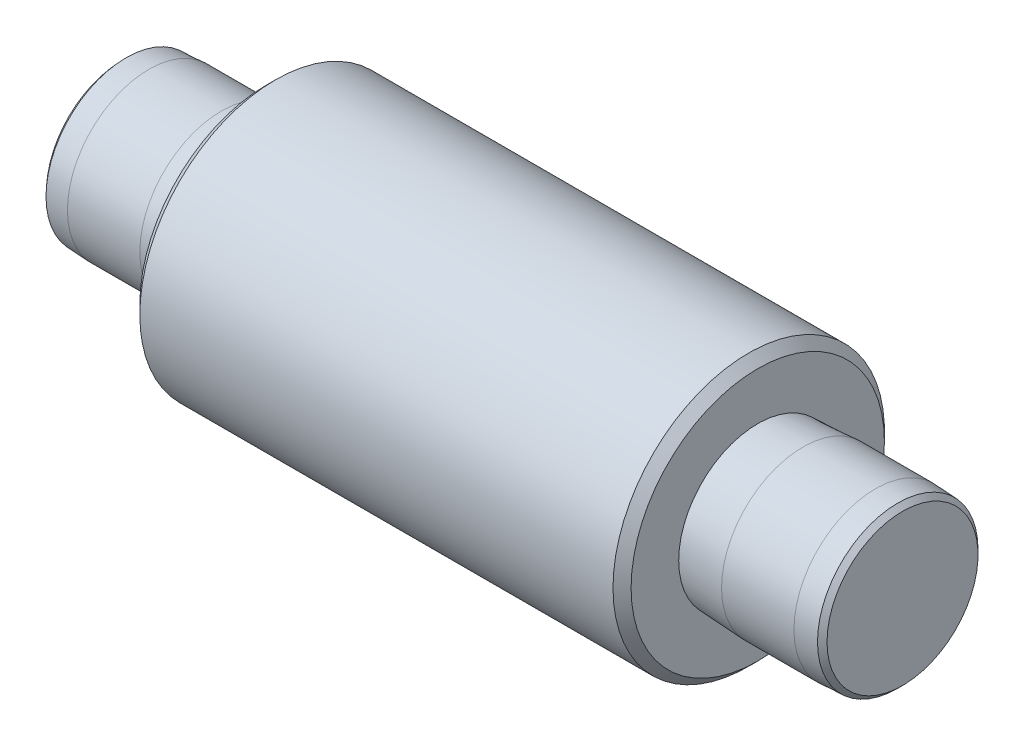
ISO-10303-21;
HEADER;
FILE_DESCRIPTION(('STEP AP214'),'2;1');
FILE_NAME('part.step','',(''),(''),'','','');
FILE_SCHEMA(('AUTOMOTIVE_DESIGN { 1 0 10303 214 1 1 1 1 }'));
ENDSEC;
DATA;
#1=APPLICATION_CONTEXT('core data for automotive mechanical design processes');
#2=APPLICATION_PROTOCOL_DEFINITION('international standard','automotive_design',2000,#1);
#3=PRODUCT_CONTEXT('',#1,'mechanical');
#4=PRODUCT('Part','Part','',(#3));
#5=PRODUCT_RELATED_PRODUCT_CATEGORY('part','',(#4));
#6=PRODUCT_DEFINITION_FORMATION('','',#4);
#7=PRODUCT_DEFINITION_CONTEXT('part definition',#1,'design');
#8=PRODUCT_DEFINITION('design','',#6,#7);
#9=PRODUCT_DEFINITION_SHAPE('','',#8);
#10=(LENGTH_UNIT() NAMED_UNIT(*) SI_UNIT(.MILLI.,.METRE.));
#11=(NAMED_UNIT(*) PLANE_ANGLE_UNIT() SI_UNIT($,.RADIAN.));
#12=(NAMED_UNIT(*) SI_UNIT($,.STERADIAN.) SOLID_ANGLE_UNIT());
#13=UNCERTAINTY_MEASURE_WITH_UNIT(LENGTH_MEASURE(1.E-05),#10,'distance_accuracy_value','');
#14=(GEOMETRIC_REPRESENTATION_CONTEXT(3) GLOBAL_UNCERTAINTY_ASSIGNED_CONTEXT((#13)) GLOBAL_UNIT_ASSIGNED_CONTEXT((#10,
#11,#12)) REPRESENTATION_CONTEXT('',''));
#15=CARTESIAN_POINT('',(0.,0.,0.));
#16=DIRECTION('',(0.,0.,1.));
#17=DIRECTION('',(1.,0.,0.));
#18=AXIS2_PLACEMENT_3D('',#15,#16,#17);
#19=CARTESIAN_POINT('',(-130.,0.,0.));
#20=DIRECTION('',(-1.,0.,0.));
#21=DIRECTION('',(0.,0.,1.));
#22=AXIS2_PLACEMENT_3D('',#19,#20,#21);
#23=CYLINDRICAL_SURFACE('',#22,9.);
#24=CARTESIAN_POINT('',(-109.838114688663,0.,0.));
#25=DIRECTION('',(-1.,0.,0.));
#26=DIRECTION('',(0.,0.,1.));
#27=AXIS2_PLACEMENT_3D('',#24,#25,#26);
#28=CIRCLE('',#27,9.);
#29=CARTESIAN_POINT('',(-109.838114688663,0.,9.));
#30=VERTEX_POINT('',#29);
#31=EDGE_CURVE('E61',#30,#30,#28,.T.);
#32=ORIENTED_EDGE('',*,*,#31,.F.);
#33=EDGE_LOOP('',(#32));
#34=FACE_BOUND('',#33,.T.);
#35=CARTESIAN_POINT('',(-101.838114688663,0.,0.));
#36=DIRECTION('',(-1.,0.,0.));
#37=DIRECTION('',(0.,0.,1.));
#38=AXIS2_PLACEMENT_3D('',#35,#36,#37);
#39=CIRCLE('',#38,9.);
#40=CARTESIAN_POINT('',(-101.838114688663,0.,9.));
#41=VERTEX_POINT('',#40);
#42=EDGE_CURVE('E76',#41,#41,#39,.T.);
#43=ORIENTED_EDGE('',*,*,#42,.T.);
#44=EDGE_LOOP('',(#43));
#45=FACE_BOUND('',#44,.T.);
#46=ADVANCED_FACE('F29',(#34,#45),#23,.T.);
#47=CARTESIAN_POINT('',(-109.838114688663,0.,0.));
#48=DIRECTION('',(1.,0.,0.));
#49=DIRECTION('',(0.,0.,-1.));
#50=AXIS2_PLACEMENT_3D('',#47,#48,#49);
#51=CONICAL_SURFACE('',#50,9.,0.0523598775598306);
#52=CARTESIAN_POINT('',(-112.338799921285,0.,0.));
#53=DIRECTION('',(-1.,0.,0.));
#54=DIRECTION('',(0.,0.,1.));
#55=AXIS2_PLACEMENT_3D('',#52,#53,#54);
#56=CIRCLE('',#55,8.86894464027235);
#57=CARTESIAN_POINT('',(-112.338799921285,0.,8.86894464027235));
#58=VERTEX_POINT('',#57);
#59=EDGE_CURVE('E10',#58,#58,#56,.F.);
#60=ORIENTED_EDGE('',*,*,#59,.T.);
#61=EDGE_LOOP('',(#60));
#62=FACE_BOUND('',#61,.T.);
#63=ORIENTED_EDGE('',*,*,#31,.T.);
#64=EDGE_LOOP('',(#63));
#65=FACE_BOUND('',#64,.T.);
#66=ADVANCED_FACE('F100',(#62,#65),#51,.T.);
#67=CARTESIAN_POINT('',(-112.838114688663,8.84277666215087,0.));
#68=DIRECTION('',(1.,0.,0.));
#69=DIRECTION('',(0.,0.,-1.));
#70=AXIS2_PLACEMENT_3D('',#67,#68,#69);
#71=PLANE('',#70);
#72=CARTESIAN_POINT('',(-112.838114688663,0.,0.));
#73=DIRECTION('',(1.,0.,0.));
#74=DIRECTION('',(0.,0.,-1.));
#75=AXIS2_PLACEMENT_3D('',#72,#73,#74);
#76=CIRCLE('',#75,8.31439941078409);
#77=CARTESIAN_POINT('',(-112.838114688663,0.,-8.31439941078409));
#78=VERTEX_POINT('',#77);
#79=EDGE_CURVE('E36',#78,#78,#76,.F.);
#80=ORIENTED_EDGE('',*,*,#79,.T.);
#81=EDGE_LOOP('',(#80));
#82=FACE_BOUND('',#81,.T.);
#83=ADVANCED_FACE('F106',(#82),#71,.F.);
#84=CARTESIAN_POINT('',(-26.5381146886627,8.84277666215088,0.));
#85=DIRECTION('',(-1.,0.,0.));
#86=DIRECTION('',(0.,0.,1.));
#87=AXIS2_PLACEMENT_3D('',#84,#85,#86);
#88=PLANE('',#87);
#89=CARTESIAN_POINT('',(-26.5381146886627,0.,0.));
#90=DIRECTION('',(-1.,0.,0.));
#91=DIRECTION('',(0.,0.,1.));
#92=AXIS2_PLACEMENT_3D('',#89,#90,#91);
#93=CIRCLE('',#92,8.34277666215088);
#94=CARTESIAN_POINT('',(-26.5381146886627,0.,8.34277666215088));
#95=VERTEX_POINT('',#94);
#96=EDGE_CURVE('E40',#95,#95,#93,.F.);
#97=ORIENTED_EDGE('',*,*,#96,.T.);
#98=EDGE_LOOP('',(#97));
#99=FACE_BOUND('',#98,.T.);
#100=ADVANCED_FACE('F132',(#99),#88,.F.);
#101=CARTESIAN_POINT('',(-26.5381146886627,0.,0.));
#102=DIRECTION('',(-1.,0.,0.));
#103=DIRECTION('',(0.,0.,1.));
#104=AXIS2_PLACEMENT_3D('',#101,#102,#103);
#105=CONICAL_SURFACE('',#104,8.84277666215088,0.0523598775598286);
#106=CARTESIAN_POINT('',(-27.0657678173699,0.,0.));
#107=DIRECTION('',(1.,0.,0.));
#108=DIRECTION('',(0.,0.,-1.));
#109=AXIS2_PLACEMENT_3D('',#106,#107,#108);
#110=CIRCLE('',#109,8.87042979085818);
#111=CARTESIAN_POINT('',(-27.0657678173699,0.,-8.87042979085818));
#112=VERTEX_POINT('',#111);
#113=EDGE_CURVE('E44',#112,#112,#110,.F.);
#114=ORIENTED_EDGE('',*,*,#113,.T.);
#115=EDGE_LOOP('',(#114));
#116=FACE_BOUND('',#115,.T.);
#117=CARTESIAN_POINT('',(-29.5381146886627,0.,0.));
#118=DIRECTION('',(-1.,0.,0.));
#119=DIRECTION('',(0.,0.,1.));
#120=AXIS2_PLACEMENT_3D('',#117,#118,#119);
#121=CIRCLE('',#120,9.);
#122=CARTESIAN_POINT('',(-29.5381146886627,0.,9.));
#123=VERTEX_POINT('',#122);
#124=EDGE_CURVE('E64',#123,#123,#121,.T.);
#125=ORIENTED_EDGE('',*,*,#124,.F.);
#126=EDGE_LOOP('',(#125));
#127=FACE_BOUND('',#126,.T.);
#128=ADVANCED_FACE('F128',(#116,#127),#105,.T.);
#129=CARTESIAN_POINT('',(-130.,0.,0.));
#130=DIRECTION('',(-1.,0.,0.));
#131=DIRECTION('',(0.,0.,1.));
#132=AXIS2_PLACEMENT_3D('',#129,#130,#131);
#133=CYLINDRICAL_SURFACE('',#132,9.);
#134=CARTESIAN_POINT('',(-37.5381146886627,0.,0.));
#135=DIRECTION('',(-1.,0.,0.));
#136=DIRECTION('',(0.,0.,1.));
#137=AXIS2_PLACEMENT_3D('',#134,#135,#136);
#138=CIRCLE('',#137,9.);
#139=CARTESIAN_POINT('',(-37.5381146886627,0.,9.));
#140=VERTEX_POINT('',#139);
#141=EDGE_CURVE('E67',#140,#140,#138,.T.);
#142=ORIENTED_EDGE('',*,*,#141,.F.);
#143=EDGE_LOOP('',(#142));
#144=FACE_BOUND('',#143,.T.);
#145=ORIENTED_EDGE('',*,*,#124,.T.);
#146=EDGE_LOOP('',(#145));
#147=FACE_BOUND('',#146,.T.);
#148=ADVANCED_FACE('F131',(#144,#147),#133,.T.);
#149=CARTESIAN_POINT('',(-37.5381146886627,0.,0.));
#150=DIRECTION('',(1.,0.,0.));
#151=DIRECTION('',(0.,0.,-1.));
#152=AXIS2_PLACEMENT_3D('',#149,#150,#151);
#153=CONICAL_SURFACE('',#152,9.,0.0523598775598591);
#154=CARTESIAN_POINT('',(-42.5381146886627,0.,0.));
#155=DIRECTION('',(-1.,0.,0.));
#156=DIRECTION('',(0.,0.,1.));
#157=AXIS2_PLACEMENT_3D('',#154,#155,#156);
#158=CIRCLE('',#157,8.73796110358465);
#159=CARTESIAN_POINT('',(-42.5381146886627,0.,8.73796110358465));
#160=VERTEX_POINT('',#159);
#161=EDGE_CURVE('E70',#160,#160,#158,.T.);
#162=ORIENTED_EDGE('',*,*,#161,.F.);
#163=EDGE_LOOP('',(#162));
#164=FACE_BOUND('',#163,.T.);
#165=ORIENTED_EDGE('',*,*,#141,.T.);
#166=EDGE_LOOP('',(#165));
#167=FACE_BOUND('',#166,.T.);
#168=ADVANCED_FACE('F137',(#164,#167),#153,.T.);
#169=CARTESIAN_POINT('',(-42.5381146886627,8.73796110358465,0.));
#170=DIRECTION('',(-1.,0.,0.));
#171=DIRECTION('',(0.,0.,1.));
#172=AXIS2_PLACEMENT_3D('',#169,#170,#171);
#173=PLANE('',#172);
#174=CARTESIAN_POINT('',(-42.5381146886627,0.,0.));
#175=DIRECTION('',(-1.,0.,0.));
#176=DIRECTION('',(0.,0.,1.));
#177=AXIS2_PLACEMENT_3D('',#174,#175,#176);
#178=CIRCLE('',#177,14.);
#179=CARTESIAN_POINT('',(-42.5381146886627,0.,14.));
#180=VERTEX_POINT('',#179);
#181=EDGE_CURVE('E52',#180,#180,#178,.F.);
#182=ORIENTED_EDGE('',*,*,#181,.T.);
#183=EDGE_LOOP('',(#182));
#184=FACE_BOUND('',#183,.T.);
#185=ORIENTED_EDGE('',*,*,#161,.T.);
#186=EDGE_LOOP('',(#185));
#187=FACE_BOUND('',#186,.T.);
#188=ADVANCED_FACE('F96',(#184,#187),#173,.F.);
#189=CARTESIAN_POINT('',(-130.,0.,0.));
#190=DIRECTION('',(-1.,0.,0.));
#191=DIRECTION('',(0.,0.,1.));
#192=AXIS2_PLACEMENT_3D('',#189,#190,#191);
#193=CYLINDRICAL_SURFACE('',#192,15.);
#194=CARTESIAN_POINT('',(-43.5381146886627,0.,0.));
#195=DIRECTION('',(-1.,0.,0.));
#196=DIRECTION('',(0.,0.,1.));
#197=AXIS2_PLACEMENT_3D('',#194,#195,#196);
#198=CIRCLE('',#197,15.);
#199=CARTESIAN_POINT('',(-43.5381146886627,0.,15.));
#200=VERTEX_POINT('',#199);
#201=EDGE_CURVE('E55',#200,#200,#198,.T.);
#202=ORIENTED_EDGE('',*,*,#201,.T.);
#203=EDGE_LOOP('',(#202));
#204=FACE_BOUND('',#203,.T.);
#205=CARTESIAN_POINT('',(-95.8381146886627,0.,0.));
#206=DIRECTION('',(1.,0.,0.));
#207=DIRECTION('',(0.,0.,-1.));
#208=AXIS2_PLACEMENT_3D('',#205,#206,#207);
#209=CIRCLE('',#208,15.);
#210=CARTESIAN_POINT('',(-95.8381146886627,0.,-15.));
#211=VERTEX_POINT('',#210);
#212=EDGE_CURVE('E58',#211,#211,#209,.T.);
#213=ORIENTED_EDGE('',*,*,#212,.T.);
#214=EDGE_LOOP('',(#213));
#215=FACE_BOUND('',#214,.T.);
#216=ADVANCED_FACE('F90',(#204,#215),#193,.T.);
#217=CARTESIAN_POINT('',(-96.8381146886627,8.73796110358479,0.));
#218=DIRECTION('',(1.,0.,0.));
#219=DIRECTION('',(0.,0.,-1.));
#220=AXIS2_PLACEMENT_3D('',#217,#218,#219);
#221=PLANE('',#220);
#222=CARTESIAN_POINT('',(-96.8381146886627,0.,0.));
#223=DIRECTION('',(1.,0.,0.));
#224=DIRECTION('',(0.,0.,-1.));
#225=AXIS2_PLACEMENT_3D('',#222,#223,#224);
#226=CIRCLE('',#225,14.);
#227=CARTESIAN_POINT('',(-96.8381146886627,0.,-14.));
#228=VERTEX_POINT('',#227);
#229=EDGE_CURVE('E49',#228,#228,#226,.F.);
#230=ORIENTED_EDGE('',*,*,#229,.T.);
#231=EDGE_LOOP('',(#230));
#232=FACE_BOUND('',#231,.T.);
#233=CARTESIAN_POINT('',(-96.8381146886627,0.,0.));
#234=DIRECTION('',(-1.,0.,0.));
#235=DIRECTION('',(0.,0.,1.));
#236=AXIS2_PLACEMENT_3D('',#233,#234,#235);
#237=CIRCLE('',#236,8.73796110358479);
#238=CARTESIAN_POINT('',(-96.8381146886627,0.,8.73796110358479));
#239=VERTEX_POINT('',#238);
#240=EDGE_CURVE('E73',#239,#239,#237,.T.);
#241=ORIENTED_EDGE('',*,*,#240,.F.);
#242=EDGE_LOOP('',(#241));
#243=FACE_BOUND('',#242,.T.);
#244=ADVANCED_FACE('F85',(#232,#243),#221,.F.);
#245=CARTESIAN_POINT('',(-96.8381146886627,0.,0.));
#246=DIRECTION('',(-1.,0.,0.));
#247=DIRECTION('',(0.,0.,1.));
#248=AXIS2_PLACEMENT_3D('',#245,#246,#247);
#249=CONICAL_SURFACE('',#248,8.73796110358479,0.05235987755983);
#250=ORIENTED_EDGE('',*,*,#42,.F.);
#251=EDGE_LOOP('',(#250));
#252=FACE_BOUND('',#251,.T.);
#253=ORIENTED_EDGE('',*,*,#240,.T.);
#254=EDGE_LOOP('',(#253));
#255=FACE_BOUND('',#254,.T.);
#256=ADVANCED_FACE('F81',(#252,#255),#249,.T.);
#257=CARTESIAN_POINT('',(-43.5381146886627,0.,0.));
#258=DIRECTION('',(-1.,0.,0.));
#259=DIRECTION('',(0.,0.,1.));
#260=AXIS2_PLACEMENT_3D('',#257,#258,#259);
#261=CONICAL_SURFACE('',#260,15.,0.785398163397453);
#262=ORIENTED_EDGE('',*,*,#181,.F.);
#263=EDGE_LOOP('',(#262));
#264=FACE_BOUND('',#263,.T.);
#265=ORIENTED_EDGE('',*,*,#201,.F.);
#266=EDGE_LOOP('',(#265));
#267=FACE_BOUND('',#266,.T.);
#268=ADVANCED_FACE('F84',(#264,#267),#261,.T.);
#269=CARTESIAN_POINT('',(-96.8381146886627,0.,0.));
#270=DIRECTION('',(1.,0.,0.));
#271=DIRECTION('',(0.,0.,-1.));
#272=AXIS2_PLACEMENT_3D('',#269,#270,#271);
#273=CONICAL_SURFACE('',#272,14.,0.78539816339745);
#274=ORIENTED_EDGE('',*,*,#212,.F.);
#275=EDGE_LOOP('',(#274));
#276=FACE_BOUND('',#275,.T.);
#277=ORIENTED_EDGE('',*,*,#229,.F.);
#278=EDGE_LOOP('',(#277));
#279=FACE_BOUND('',#278,.T.);
#280=ADVANCED_FACE('F113',(#276,#279),#273,.T.);
#281=CARTESIAN_POINT('',(-27.0657678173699,0.,0.));
#282=DIRECTION('',(-1.,0.,0.));
#283=DIRECTION('',(0.,0.,1.));
#284=AXIS2_PLACEMENT_3D('',#281,#282,#283);
#285=CONICAL_SURFACE('',#284,8.87042979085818,0.785398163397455);
#286=ORIENTED_EDGE('',*,*,#96,.F.);
#287=EDGE_LOOP('',(#286));
#288=FACE_BOUND('',#287,.T.);
#289=ORIENTED_EDGE('',*,*,#113,.F.);
#290=EDGE_LOOP('',(#289));
#291=FACE_BOUND('',#290,.T.);
#292=ADVANCED_FACE('F116',(#288,#291),#285,.T.);
#293=CARTESIAN_POINT('',(-112.838114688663,0.,0.));
#294=DIRECTION('',(1.,0.,0.));
#295=DIRECTION('',(0.,0.,-1.));
#296=AXIS2_PLACEMENT_3D('',#293,#294,#295);
#297=CONICAL_SURFACE('',#296,8.31439941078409,0.837758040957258);
#298=ORIENTED_EDGE('',*,*,#59,.F.);
#299=EDGE_LOOP('',(#298));
#300=FACE_BOUND('',#299,.T.);
#301=ORIENTED_EDGE('',*,*,#79,.F.);
#302=EDGE_LOOP('',(#301));
#303=FACE_BOUND('',#302,.T.);
#304=ADVANCED_FACE('F31',(#300,#303),#297,.T.);
#305=CLOSED_SHELL('',(#46,#66,#83,#100,#128,#148,#168,#188,#216,#244,#256,#268,#280,#292,#304));
#306=MANIFOLD_SOLID_BREP('B2',#305);
#307=ADVANCED_BREP_SHAPE_REPRESENTATION('',(#18,#306),#14);
#308=SHAPE_DEFINITION_REPRESENTATION(#9,#307);
ENDSEC;
END-ISO-10303-21;
